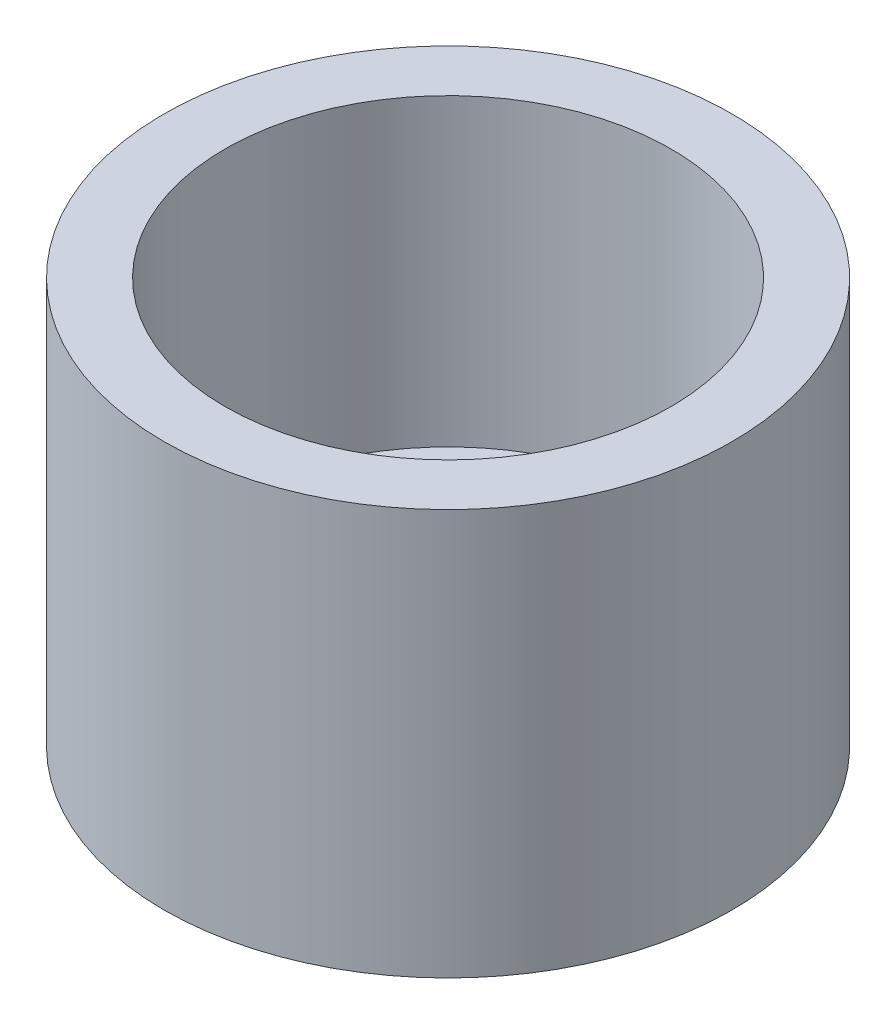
from build123d import *

# Parameters (mm, degrees)
SKETCH1_R           = 7
BOSS_EXTRUDE1_DEPTH = 10
SKETCH2_R           = 5.5
CUT_EXTRUDE1_DEPTH  = 7.5


with BuildPart() as part:
    # Sketch1 → Boss-Extrude1 (new body)
    with BuildSketch(Plane(origin=(0, 0, 0), x_dir=(1, 0, 0), z_dir=(0, 1, 0))):
        with Locations(Location((0, 0, 0), (0, 0, 270))):
            Circle(SKETCH1_R)
    extrude(amount=BOSS_EXTRUDE1_DEPTH)

    # Sketch2 → Cut-Extrude1 (cut)
    with BuildSketch(Plane(origin=(0, 10, 0), x_dir=(1, 0, 0), z_dir=(0, 1, 0))):
        with Locations(Location((0, 0, 0), (0, 0, 270))):
            Circle(SKETCH2_R)
    extrude(amount=-CUT_EXTRUDE1_DEPTH, mode=Mode.SUBTRACT)


solid = part.part
